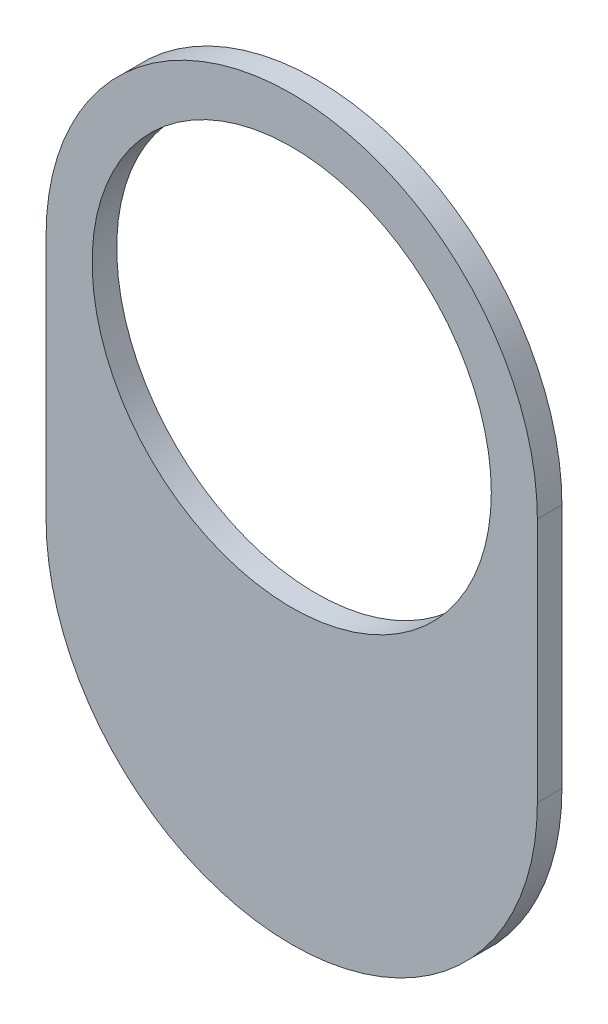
ISO-10303-21;
HEADER;
FILE_DESCRIPTION(('STEP AP214'),'2;1');
FILE_NAME('part.step','',(''),(''),'','','');
FILE_SCHEMA(('AUTOMOTIVE_DESIGN { 1 0 10303 214 1 1 1 1 }'));
ENDSEC;
DATA;
#1=APPLICATION_CONTEXT('core data for automotive mechanical design processes');
#2=APPLICATION_PROTOCOL_DEFINITION('international standard','automotive_design',2000,#1);
#3=PRODUCT_CONTEXT('',#1,'mechanical');
#4=PRODUCT('Part','Part','',(#3));
#5=PRODUCT_RELATED_PRODUCT_CATEGORY('part','',(#4));
#6=PRODUCT_DEFINITION_FORMATION('','',#4);
#7=PRODUCT_DEFINITION_CONTEXT('part definition',#1,'design');
#8=PRODUCT_DEFINITION('design','',#6,#7);
#9=PRODUCT_DEFINITION_SHAPE('','',#8);
#10=(LENGTH_UNIT() NAMED_UNIT(*) SI_UNIT(.MILLI.,.METRE.));
#11=(NAMED_UNIT(*) PLANE_ANGLE_UNIT() SI_UNIT($,.RADIAN.));
#12=(NAMED_UNIT(*) SI_UNIT($,.STERADIAN.) SOLID_ANGLE_UNIT());
#13=UNCERTAINTY_MEASURE_WITH_UNIT(LENGTH_MEASURE(1.E-05),#10,'distance_accuracy_value','');
#14=(GEOMETRIC_REPRESENTATION_CONTEXT(3) GLOBAL_UNCERTAINTY_ASSIGNED_CONTEXT((#13)) GLOBAL_UNIT_ASSIGNED_CONTEXT((#10,
#11,#12)) REPRESENTATION_CONTEXT('',''));
#15=CARTESIAN_POINT('',(0.,0.,0.));
#16=DIRECTION('',(0.,0.,1.));
#17=DIRECTION('',(1.,0.,0.));
#18=AXIS2_PLACEMENT_3D('',#15,#16,#17);
#19=CARTESIAN_POINT('',(0.,0.,1.));
#20=DIRECTION('',(0.,0.,-1.));
#21=DIRECTION('',(-1.,0.,0.));
#22=AXIS2_PLACEMENT_3D('',#19,#20,#21);
#23=PLANE('',#22);
#24=CARTESIAN_POINT('',(0.,0.,1.));
#25=DIRECTION('',(0.,0.,1.));
#26=DIRECTION('',(-1.,0.,0.));
#27=AXIS2_PLACEMENT_3D('',#24,#25,#26);
#28=CIRCLE('',#27,20.);
#29=CARTESIAN_POINT('',(20.,0.,1.));
#30=VERTEX_POINT('',#29);
#31=CARTESIAN_POINT('',(-20.,0.,1.));
#32=VERTEX_POINT('',#31);
#33=EDGE_CURVE('E85',#30,#32,#28,.T.);
#34=ORIENTED_EDGE('',*,*,#33,.T.);
#35=DIRECTION('',(0.,-1.,0.));
#36=VECTOR('',#35,1.);
#37=CARTESIAN_POINT('',(-20.,0.,1.));
#38=LINE('',#37,#36);
#39=CARTESIAN_POINT('',(-20.,-20.,1.));
#40=VERTEX_POINT('',#39);
#41=EDGE_CURVE('E80',#32,#40,#38,.T.);
#42=ORIENTED_EDGE('',*,*,#41,.T.);
#43=CARTESIAN_POINT('',(0.,-20.,1.));
#44=DIRECTION('',(0.,0.,1.));
#45=DIRECTION('',(1.,0.,0.));
#46=AXIS2_PLACEMENT_3D('',#43,#44,#45);
#47=CIRCLE('',#46,20.);
#48=CARTESIAN_POINT('',(20.,-20.,1.));
#49=VERTEX_POINT('',#48);
#50=EDGE_CURVE('E83',#40,#49,#47,.T.);
#51=ORIENTED_EDGE('',*,*,#50,.T.);
#52=DIRECTION('',(0.,1.,0.));
#53=VECTOR('',#52,1.);
#54=CARTESIAN_POINT('',(20.,0.,1.));
#55=LINE('',#54,#53);
#56=EDGE_CURVE('E50',#49,#30,#55,.T.);
#57=ORIENTED_EDGE('',*,*,#56,.T.);
#58=EDGE_LOOP('',(#34,#42,#51,#57));
#59=FACE_BOUND('',#58,.T.);
#60=CARTESIAN_POINT('',(0.,0.,1.));
#61=DIRECTION('',(0.,0.,1.));
#62=DIRECTION('',(1.,0.,0.));
#63=AXIS2_PLACEMENT_3D('',#60,#61,#62);
#64=CIRCLE('',#63,16.25);
#65=CARTESIAN_POINT('',(16.25,0.,1.));
#66=VERTEX_POINT('',#65);
#67=EDGE_CURVE('E100',#66,#66,#64,.T.);
#68=ORIENTED_EDGE('',*,*,#67,.F.);
#69=EDGE_LOOP('',(#68));
#70=FACE_BOUND('',#69,.T.);
#71=ADVANCED_FACE('F33',(#59,#70),#23,.F.);
#72=CARTESIAN_POINT('',(0.,0.,-1.));
#73=DIRECTION('',(0.,0.,-1.));
#74=DIRECTION('',(-1.,0.,0.));
#75=AXIS2_PLACEMENT_3D('',#72,#73,#74);
#76=PLANE('',#75);
#77=CARTESIAN_POINT('',(0.,0.,-1.));
#78=DIRECTION('',(0.,0.,1.));
#79=DIRECTION('',(-1.,0.,0.));
#80=AXIS2_PLACEMENT_3D('',#77,#78,#79);
#81=CIRCLE('',#80,20.);
#82=CARTESIAN_POINT('',(20.,0.,-1.));
#83=VERTEX_POINT('',#82);
#84=CARTESIAN_POINT('',(-20.,0.,-1.));
#85=VERTEX_POINT('',#84);
#86=EDGE_CURVE('E97',#83,#85,#81,.T.);
#87=ORIENTED_EDGE('',*,*,#86,.F.);
#88=DIRECTION('',(0.,1.,0.));
#89=VECTOR('',#88,1.);
#90=CARTESIAN_POINT('',(20.,0.,-1.));
#91=LINE('',#90,#89);
#92=CARTESIAN_POINT('',(20.,-20.,-1.));
#93=VERTEX_POINT('',#92);
#94=EDGE_CURVE('E73',#93,#83,#91,.T.);
#95=ORIENTED_EDGE('',*,*,#94,.F.);
#96=CARTESIAN_POINT('',(0.,-20.,-1.));
#97=DIRECTION('',(0.,0.,1.));
#98=DIRECTION('',(1.,0.,0.));
#99=AXIS2_PLACEMENT_3D('',#96,#97,#98);
#100=CIRCLE('',#99,20.);
#101=CARTESIAN_POINT('',(-20.,-20.,-1.));
#102=VERTEX_POINT('',#101);
#103=EDGE_CURVE('E67',#102,#93,#100,.T.);
#104=ORIENTED_EDGE('',*,*,#103,.F.);
#105=DIRECTION('',(0.,-1.,0.));
#106=VECTOR('',#105,1.);
#107=CARTESIAN_POINT('',(-20.,0.,-1.));
#108=LINE('',#107,#106);
#109=EDGE_CURVE('E89',#85,#102,#108,.T.);
#110=ORIENTED_EDGE('',*,*,#109,.F.);
#111=EDGE_LOOP('',(#87,#95,#104,#110));
#112=FACE_BOUND('',#111,.T.);
#113=CARTESIAN_POINT('',(0.,0.,-1.));
#114=DIRECTION('',(0.,0.,1.));
#115=DIRECTION('',(1.,0.,0.));
#116=AXIS2_PLACEMENT_3D('',#113,#114,#115);
#117=CIRCLE('',#116,16.25);
#118=CARTESIAN_POINT('',(16.25,0.,-1.));
#119=VERTEX_POINT('',#118);
#120=EDGE_CURVE('E112',#119,#119,#117,.T.);
#121=ORIENTED_EDGE('',*,*,#120,.T.);
#122=EDGE_LOOP('',(#121));
#123=FACE_BOUND('',#122,.T.);
#124=ADVANCED_FACE('F108',(#112,#123),#76,.T.);
#125=CARTESIAN_POINT('',(0.,0.,1.));
#126=DIRECTION('',(0.,0.,-1.));
#127=DIRECTION('',(-1.,0.,0.));
#128=AXIS2_PLACEMENT_3D('',#125,#126,#127);
#129=CYLINDRICAL_SURFACE('',#128,20.);
#130=ORIENTED_EDGE('',*,*,#86,.T.);
#131=DIRECTION('',(0.,0.,-1.));
#132=VECTOR('',#131,1.);
#133=CARTESIAN_POINT('',(-20.,0.,1.));
#134=LINE('',#133,#132);
#135=EDGE_CURVE('E11',#32,#85,#134,.T.);
#136=ORIENTED_EDGE('',*,*,#135,.F.);
#137=ORIENTED_EDGE('',*,*,#33,.F.);
#138=DIRECTION('',(0.,0.,-1.));
#139=VECTOR('',#138,1.);
#140=CARTESIAN_POINT('',(20.,0.,1.));
#141=LINE('',#140,#139);
#142=EDGE_CURVE('E93',#30,#83,#141,.T.);
#143=ORIENTED_EDGE('',*,*,#142,.T.);
#144=EDGE_LOOP('',(#130,#136,#137,#143));
#145=FACE_BOUND('',#144,.T.);
#146=ADVANCED_FACE('F35',(#145),#129,.T.);
#147=CARTESIAN_POINT('',(-20.,0.,1.));
#148=DIRECTION('',(1.,0.,0.));
#149=DIRECTION('',(0.,1.,0.));
#150=AXIS2_PLACEMENT_3D('',#147,#148,#149);
#151=PLANE('',#150);
#152=ORIENTED_EDGE('',*,*,#109,.T.);
#153=DIRECTION('',(0.,0.,-1.));
#154=VECTOR('',#153,1.);
#155=CARTESIAN_POINT('',(-20.,-20.,1.));
#156=LINE('',#155,#154);
#157=EDGE_CURVE('E42',#40,#102,#156,.T.);
#158=ORIENTED_EDGE('',*,*,#157,.F.);
#159=ORIENTED_EDGE('',*,*,#41,.F.);
#160=ORIENTED_EDGE('',*,*,#135,.T.);
#161=EDGE_LOOP('',(#152,#158,#159,#160));
#162=FACE_BOUND('',#161,.T.);
#163=ADVANCED_FACE('F88',(#162),#151,.F.);
#164=CARTESIAN_POINT('',(0.,-20.,1.));
#165=DIRECTION('',(0.,0.,-1.));
#166=DIRECTION('',(-1.,0.,0.));
#167=AXIS2_PLACEMENT_3D('',#164,#165,#166);
#168=CYLINDRICAL_SURFACE('',#167,20.);
#169=ORIENTED_EDGE('',*,*,#103,.T.);
#170=DIRECTION('',(0.,0.,-1.));
#171=VECTOR('',#170,1.);
#172=CARTESIAN_POINT('',(20.,-20.,1.));
#173=LINE('',#172,#171);
#174=EDGE_CURVE('E90',#49,#93,#173,.T.);
#175=ORIENTED_EDGE('',*,*,#174,.F.);
#176=ORIENTED_EDGE('',*,*,#50,.F.);
#177=ORIENTED_EDGE('',*,*,#157,.T.);
#178=EDGE_LOOP('',(#169,#175,#176,#177));
#179=FACE_BOUND('',#178,.T.);
#180=ADVANCED_FACE('F91',(#179),#168,.T.);
#181=CARTESIAN_POINT('',(20.,0.,1.));
#182=DIRECTION('',(-1.,0.,0.));
#183=DIRECTION('',(0.,-1.,0.));
#184=AXIS2_PLACEMENT_3D('',#181,#182,#183);
#185=PLANE('',#184);
#186=ORIENTED_EDGE('',*,*,#94,.T.);
#187=ORIENTED_EDGE('',*,*,#142,.F.);
#188=ORIENTED_EDGE('',*,*,#56,.F.);
#189=ORIENTED_EDGE('',*,*,#174,.T.);
#190=EDGE_LOOP('',(#186,#187,#188,#189));
#191=FACE_BOUND('',#190,.T.);
#192=ADVANCED_FACE('F105',(#191),#185,.F.);
#193=CARTESIAN_POINT('',(0.,0.,1.));
#194=DIRECTION('',(0.,0.,-1.));
#195=DIRECTION('',(-1.,0.,0.));
#196=AXIS2_PLACEMENT_3D('',#193,#194,#195);
#197=CYLINDRICAL_SURFACE('',#196,16.25);
#198=ORIENTED_EDGE('',*,*,#67,.T.);
#199=EDGE_LOOP('',(#198));
#200=FACE_BOUND('',#199,.T.);
#201=ORIENTED_EDGE('',*,*,#120,.F.);
#202=EDGE_LOOP('',(#201));
#203=FACE_BOUND('',#202,.T.);
#204=ADVANCED_FACE('F118',(#200,#203),#197,.F.);
#205=CLOSED_SHELL('',(#71,#124,#146,#163,#180,#192,#204));
#206=MANIFOLD_SOLID_BREP('B2',#205);
#207=ADVANCED_BREP_SHAPE_REPRESENTATION('',(#18,#206),#14);
#208=SHAPE_DEFINITION_REPRESENTATION(#9,#207);
ENDSEC;
END-ISO-10303-21;
